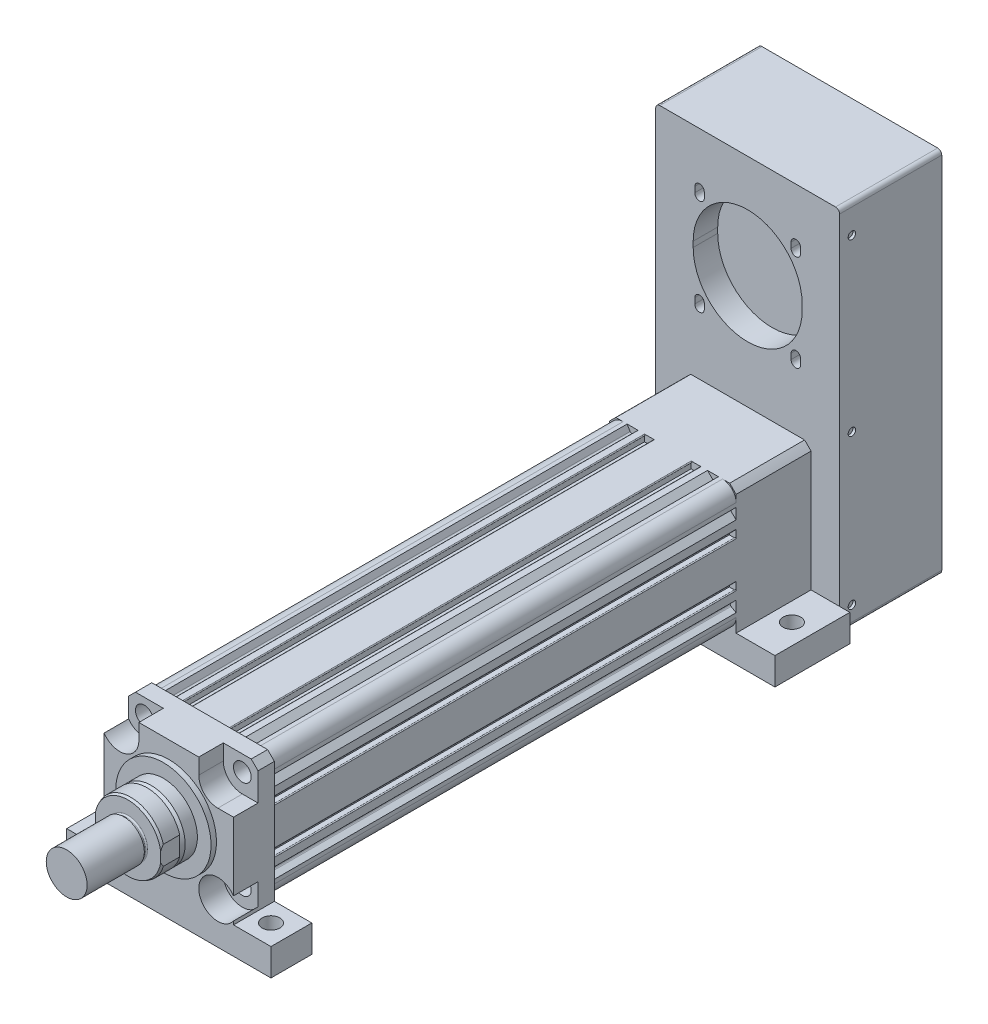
from build123d import *
from OCP.BRepFilletAPI import BRepFilletAPI_MakeChamfer

# Parameters (mm, degrees)
SKETCH_1_R           = 40
SKETCH_1_R_2         = 4.35
EXTRUDE_1_DEPTH      = 340
EXTRUDE_1_2_DEPTH    = 30
SKETCH_3_R           = 35
EXTRUDE_2_DEPTH      = 4
SKETCH_3_3_R         = 6.5
CUT_EXTRUDE_1_DEPTH  = 30
SKETCH_3_4_R         = 6.5
CUT_EXTRUDE_2_DEPTH  = 17
SKETCH_4_R           = 25
EXTRUDE_3_DEPTH      = 12
CHAMFER_1_SIZE       = 3
CHAMFER_1_SIZE2      = 1.732050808
EXTRUDE_4_DEPTH      = 14
CHAMFER_2_SIZE       = 2
CHAMFER_2_SIZE2      = 0.727940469
SKETCH_6_R           = 13.5
EXTRUDE_5_DEPTH      = 3
SKETCH_7_R           = 15
EXTRUDE_6_DEPTH      = 42
FILLET_1_R           = 1
EXTRUDE_7_DEPTH      = 55
SKETCH_12_W          = 135
SKETCH_12_H          = 270
EXTRUDE_9_DEPTH      = 75
CUT_EXTRUDE_5_DEPTH  = 18
CUT_EXTRUDE_6_DEPTH  = 18
CUT_EXTRUDE_START    = -11.5
CUT_EXTRUDE_7_DEPTH  = 6.5
SKETCH_14_R          = 2.75
CUT_EXTRUDE_8_DEPTH  = 2
SKETCH_15_R          = 2.75
CUT_EXTRUDE_9_DEPTH  = 2
SKETCH_16_W          = 150
SKETCH_16_H          = 55
SKETCH_16_R          = 6.5
SKETCH_16_H_2        = 30
EXTRUDE_10_DEPTH     = 20
FILLET_2_R           = 3
SKETCH_17_W          = 95
SKETCH_17_H          = 95
EXTRUDE_11_DEPTH     = 30
CUT_EXTRUDE_10_DEPTH = 18
SKETCH_19_R          = 6.5
CUT_EXTRUDE_11_DEPTH = 30
CHAMFER_3_SIZE       = 5


with BuildPart() as part:
    # Sketch 1 → Extrude 1 (new body)
    with BuildSketch(Plane.XY):
        with BuildLine():
            Line((46.5, -36.5), (46.5, -33.5))
            Line((46.5, -33.5), (42.782554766, -31.353731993))
            ThreePointArc((42.782554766, -31.353731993), (42.192820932, -30.47113294), (42.534026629, -29.465973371))
            Line((42.534026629, -29.465973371), (46.5, -25.5))
            Line((46.5, -25.5), (46.5, -19.6))
            ThreePointArc((46.5, -19.6), (46.353553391, -19.246446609), (46, -19.1))
            ThreePointArc((46, -19.1), (45.646446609, -19.246446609), (45.5, -19.6))
            Line((45.5, -19.6), (41.5, -19.6))
            Line((41.5, -19.6), (41.5, -13.5))
            Line((41.5, -13.5), (45.5, -13.5))
            ThreePointArc((45.5, -13.5), (45.646446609, -13.853553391), (46, -14))
            ThreePointArc((46, -14), (46.353553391, -13.853553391), (46.5, -13.5))
            Line((46.5, -13.5), (46.5, 13.5))
            ThreePointArc((46.5, 13.5), (46.353553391, 13.853553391), (46, 14))
            ThreePointArc((46, 14), (45.646446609, 13.853553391), (45.5, 13.5))
            Line((45.5, 13.5), (41.5, 13.5))
            Line((41.5, 13.5), (41.5, 19.6))
            Line((41.5, 19.6), (45.5, 19.6))
            ThreePointArc((45.5, 19.6), (45.646446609, 19.246446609), (46, 19.1))
            ThreePointArc((46, 19.1), (46.353553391, 19.246446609), (46.5, 19.6))
            Line((46.5, 19.6), (46.5, 25.5))
            Line((46.5, 25.5), (42.534026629, 29.465973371))
            ThreePointArc((42.534026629, 29.465973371), (42.192820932, 30.47113294), (42.782554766, 31.353731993))
            Line((42.782554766, 31.353731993), (46.5, 33.5))
            Line((46.5, 33.5), (46.5, 36.5))
            ThreePointArc((46.5, 36.5), (43.571067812, 43.571067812), (36.5, 46.5))
            Line((36.5, 46.5), (33.5, 46.5))
            Line((33.5, 46.5), (31.353731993, 42.782554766))
            ThreePointArc((31.353731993, 42.782554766), (30.47113294, 42.192820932), (29.465973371, 42.534026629))
            Line((29.465973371, 42.534026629), (25.5, 46.5))
            Line((25.5, 46.5), (20.8, 46.5))
            ThreePointArc((20.8, 46.5), (20.446446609, 46.353553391), (20.3, 46))
            ThreePointArc((20.3, 46), (20.446446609, 45.646446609), (20.8, 45.5))
            Line((20.8, 45.5), (20.8, 41.5))
            Line((20.8, 41.5), (13.5, 41.5))
            Line((13.5, 41.5), (13.5, 45.5))
            ThreePointArc((13.5, 45.5), (13.853553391, 45.646446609), (14, 46))
            ThreePointArc((14, 46), (13.853553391, 46.353553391), (13.5, 46.5))
            Line((13.5, 46.5), (-13.5, 46.5))
            ThreePointArc((-13.5, 46.5), (-13.853553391, 46.353553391), (-14, 46))
            ThreePointArc((-14, 46), (-13.853553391, 45.646446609), (-13.5, 45.5))
            Line((-13.5, 45.5), (-13.5, 41.5))
            Line((-13.5, 41.5), (-20.8, 41.5))
            Line((-20.8, 41.5), (-20.8, 45.5))
            ThreePointArc((-20.8, 45.5), (-20.446446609, 45.646446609), (-20.3, 46))
            ThreePointArc((-20.3, 46), (-20.446446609, 46.353553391), (-20.8, 46.5))
            Line((-20.8, 46.5), (-25.5, 46.5))
            Line((-25.5, 46.5), (-29.465973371, 42.534026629))
            ThreePointArc((-29.465973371, 42.534026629), (-30.47113294, 42.192820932), (-31.353731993, 42.782554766))
            Line((-31.353731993, 42.782554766), (-33.5, 46.5))
            Line((-33.5, 46.5), (-36.5, 46.5))
            ThreePointArc((-36.5, 46.5), (-43.571067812, 43.571067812), (-46.5, 36.5))
            Line((-46.5, 36.5), (-46.5, 33.5))
            Line((-46.5, 33.5), (-42.782554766, 31.353731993))
            ThreePointArc((-42.782554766, 31.353731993), (-42.192820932, 30.47113294), (-42.534026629, 29.465973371))
            Line((-42.534026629, 29.465973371), (-46.5, 25.5))
            Line((-46.5, 25.5), (-46.5, 20))
            ThreePointArc((-46.5, 20), (-46.353553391, 19.646446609), (-46, 19.5))
            ThreePointArc((-46, 19.5), (-45.646446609, 19.646446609), (-45.5, 20))
            Line((-45.5, 20), (-41.5, 20))
            Line((-41.5, 20), (-41.5, 13.9))
            Line((-41.5, 13.9), (-45.5, 13.9))
            ThreePointArc((-45.5, 13.9), (-45.646446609, 14.253553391), (-46, 14.4))
            ThreePointArc((-46, 14.4), (-46.353553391, 14.253553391), (-46.5, 13.9))
            Line((-46.5, 13.9), (-46.5, -13.9))
            ThreePointArc((-46.5, -13.9), (-46.353553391, -14.253553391), (-46, -14.4))
            ThreePointArc((-46, -14.4), (-45.646446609, -14.253553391), (-45.5, -13.9))
            Line((-45.5, -13.9), (-41.5, -13.9))
            Line((-41.5, -13.9), (-41.5, -20))
            Line((-41.5, -20), (-45.5, -20))
            ThreePointArc((-45.5, -20), (-45.646446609, -19.646446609), (-46, -19.5))
            ThreePointArc((-46, -19.5), (-46.353553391, -19.646446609), (-46.5, -20))
            Line((-46.5, -20), (-46.5, -25.5))
            Line((-46.5, -25.5), (-42.534026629, -29.465973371))
            ThreePointArc((-42.534026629, -29.465973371), (-42.192820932, -30.47113294), (-42.782554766, -31.353731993))
            Line((-42.782554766, -31.353731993), (-46.5, -33.5))
            Line((-46.5, -33.5), (-46.5, -36.5))
            ThreePointArc((-46.5, -36.5), (-43.571067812, -43.571067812), (-36.5, -46.5))
            Line((-36.5, -46.5), (-33.5, -46.5))
            Line((-33.5, -46.5), (-31.353731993, -42.782554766))
            ThreePointArc((-31.353731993, -42.782554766), (-30.47113294, -42.192820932), (-29.465973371, -42.534026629))
            Line((-29.465973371, -42.534026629), (-25.5, -46.5))
            Line((-25.5, -46.5), (25.5, -46.5))
            Line((25.5, -46.5), (29.465973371, -42.534026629))
            ThreePointArc((29.465973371, -42.534026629), (30.47113294, -42.192820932), (31.353731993, -42.782554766))
            Line((31.353731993, -42.782554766), (33.5, -46.5))
            Line((33.5, -46.5), (36.5, -46.5))
            ThreePointArc((36.5, -46.5), (43.571067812, -43.571067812), (46.5, -36.5))
        make_face()
        Circle(SKETCH_1_R, mode=Mode.SUBTRACT)
        with Locations((36, -36)):
            Circle(SKETCH_1_R_2, mode=Mode.SUBTRACT)
        with Locations((-36, -36)):
            Circle(SKETCH_1_R_2, mode=Mode.SUBTRACT)
        with Locations((36, 36)):
            Circle(SKETCH_1_R_2, mode=Mode.SUBTRACT)
        with Locations((-36, 36)):
            Circle(SKETCH_1_R_2, mode=Mode.SUBTRACT)
        with BuildLine():
            Line((25.75, -42.5), (11.324751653, -42.5))
            ThreePointArc((11.324751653, -42.5), (10.829080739, -42.065653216), (11.194582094, -41.517241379))
            ThreePointArc((11.194582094, -41.517241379), (18.919894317, -38.613956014), (25.948275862, -34.288292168))
            ThreePointArc((25.948275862, -34.288292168), (26.472640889, -34.239297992), (26.75, -34.68699324))
            Line((26.75, -34.68699324), (26.75, -41.5))
            Line((26.75, -41.5), (25.75, -42.5))
        make_face(mode=Mode.SUBTRACT)
        with BuildLine():
            Line((-25.75, -42.5), (-11.324751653, -42.5))
            ThreePointArc((-11.324751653, -42.5), (-10.829080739, -42.065653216), (-11.194582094, -41.517241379))
            ThreePointArc((-11.194582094, -41.517241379), (-18.919894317, -38.613956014), (-25.948275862, -34.288292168))
            ThreePointArc((-25.948275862, -34.288292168), (-26.472640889, -34.239297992), (-26.75, -34.68699324))
            Line((-26.75, -34.68699324), (-26.75, -41.5))
            Line((-26.75, -41.5), (-25.75, -42.5))
        make_face(mode=Mode.SUBTRACT)
        with BuildLine():
            Line((26.312283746, 40), (20.798294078, 40))
            ThreePointArc((20.798294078, 40), (20.548294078, 39.933012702), (20.365281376, 39.75))
            Line((20.365281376, 39.75), (19.794336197, 38.761093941))
            ThreePointArc((19.794336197, 38.761093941), (19.747068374, 38.372059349), (19.994850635, 38.068437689))
            ThreePointArc((19.994850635, 38.068437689), (22.57372353, 36.598183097), (25.045011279, 34.953503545))
            ThreePointArc((25.045011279, 34.953503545), (25.441798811, 34.871210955), (25.769245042, 35.109939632))
            Line((25.769245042, 35.109939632), (27.64187192, 38.353424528))
            ThreePointArc((27.64187192, 38.353424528), (27.704581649, 38.668687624), (27.562412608, 38.956977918))
            Line((27.562412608, 38.956977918), (26.665837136, 39.853553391))
            ThreePointArc((26.665837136, 39.853553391), (26.503625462, 39.961939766), (26.312283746, 40))
        make_face(mode=Mode.SUBTRACT)
        with BuildLine():
            Line((38.956977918, 27.562412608), (39.853553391, 26.665837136))
            ThreePointArc((39.853553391, 26.665837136), (39.961939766, 26.503625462), (40, 26.312283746))
            Line((40, 26.312283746), (40, 20.798294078))
            ThreePointArc((40, 20.798294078), (39.933012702, 20.548294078), (39.75, 20.365281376))
            Line((39.75, 20.365281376), (38.761093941, 19.794336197))
            ThreePointArc((38.761093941, 19.794336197), (38.372059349, 19.747068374), (38.068437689, 19.994850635))
            ThreePointArc((38.068437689, 19.994850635), (36.598183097, 22.57372353), (34.953503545, 25.045011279))
            ThreePointArc((34.953503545, 25.045011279), (34.871210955, 25.441798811), (35.109939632, 25.769245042))
            Line((35.109939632, 25.769245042), (38.353424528, 27.64187192))
            ThreePointArc((38.353424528, 27.64187192), (38.668687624, 27.704581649), (38.956977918, 27.562412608))
        make_face(mode=Mode.SUBTRACT)
        with BuildLine():
            Line((38.956977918, -27.562412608), (39.853553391, -26.665837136))
            ThreePointArc((39.853553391, -26.665837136), (39.961939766, -26.503625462), (40, -26.312283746))
            Line((40, -26.312283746), (40, -20.798294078))
            ThreePointArc((40, -20.798294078), (39.933012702, -20.548294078), (39.75, -20.365281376))
            Line((39.75, -20.365281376), (38.761093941, -19.794336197))
            ThreePointArc((38.761093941, -19.794336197), (38.372059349, -19.747068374), (38.068437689, -19.994850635))
            ThreePointArc((38.068437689, -19.994850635), (36.598183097, -22.57372353), (34.953503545, -25.045011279))
            ThreePointArc((34.953503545, -25.045011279), (34.871210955, -25.441798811), (35.109939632, -25.769245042))
            Line((35.109939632, -25.769245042), (38.353424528, -27.64187192))
            ThreePointArc((38.353424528, -27.64187192), (38.668687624, -27.704581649), (38.956977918, -27.562412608))
        make_face(mode=Mode.SUBTRACT)
        with BuildLine():
            Line((-39.75, -20.365281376), (-38.761093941, -19.794336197))
            ThreePointArc((-38.761093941, -19.794336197), (-38.372059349, -19.747068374), (-38.068437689, -19.994850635))
            ThreePointArc((-38.068437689, -19.994850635), (-36.598183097, -22.57372353), (-34.953503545, -25.045011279))
            ThreePointArc((-34.953503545, -25.045011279), (-34.871210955, -25.441798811), (-35.109939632, -25.769245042))
            Line((-35.109939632, -25.769245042), (-38.353424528, -27.64187192))
            ThreePointArc((-38.353424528, -27.64187192), (-38.668687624, -27.704581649), (-38.956977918, -27.562412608))
            Line((-38.956977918, -27.562412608), (-39.853553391, -26.665837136))
            ThreePointArc((-39.853553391, -26.665837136), (-39.961939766, -26.503625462), (-40, -26.312283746))
            Line((-40, -26.312283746), (-40, -20.798294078))
            ThreePointArc((-40, -20.798294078), (-39.933012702, -20.548294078), (-39.75, -20.365281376))
        make_face(mode=Mode.SUBTRACT)
        with BuildLine():
            Line((-20.365281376, 39.75), (-19.794336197, 38.761093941))
            ThreePointArc((-19.794336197, 38.761093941), (-19.747068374, 38.372059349), (-19.994850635, 38.068437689))
            ThreePointArc((-19.994850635, 38.068437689), (-22.57372353, 36.598183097), (-25.045011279, 34.953503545))
            ThreePointArc((-25.045011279, 34.953503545), (-25.441798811, 34.871210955), (-25.769245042, 35.109939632))
            Line((-25.769245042, 35.109939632), (-27.64187192, 38.353424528))
            ThreePointArc((-27.64187192, 38.353424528), (-27.704581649, 38.668687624), (-27.562412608, 38.956977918))
            Line((-27.562412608, 38.956977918), (-26.665837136, 39.853553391))
            ThreePointArc((-26.665837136, 39.853553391), (-26.503625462, 39.961939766), (-26.312283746, 40))
            Line((-26.312283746, 40), (-20.798294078, 40))
            ThreePointArc((-20.798294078, 40), (-20.548294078, 39.933012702), (-20.365281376, 39.75))
        make_face(mode=Mode.SUBTRACT)
        with BuildLine():
            Line((-38.956977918, 27.562412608), (-39.853553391, 26.665837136))
            ThreePointArc((-39.853553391, 26.665837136), (-39.961939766, 26.503625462), (-40, 26.312283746))
            Line((-40, 26.312283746), (-40, 20.798294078))
            ThreePointArc((-40, 20.798294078), (-39.933012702, 20.548294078), (-39.75, 20.365281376))
            Line((-39.75, 20.365281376), (-38.761093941, 19.794336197))
            ThreePointArc((-38.761093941, 19.794336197), (-38.372059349, 19.747068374), (-38.068437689, 19.994850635))
            ThreePointArc((-38.068437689, 19.994850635), (-36.598183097, 22.57372353), (-34.953503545, 25.045011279))
            ThreePointArc((-34.953503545, 25.045011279), (-34.871210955, 25.441798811), (-35.109939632, 25.769245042))
            Line((-35.109939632, 25.769245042), (-38.353424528, 27.64187192))
            ThreePointArc((-38.353424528, 27.64187192), (-38.668687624, 27.704581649), (-38.956977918, 27.562412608))
        make_face(mode=Mode.SUBTRACT)
    extrude(amount=EXTRUDE_1_DEPTH)

    # Sketch 2 → Extrude 1 2 (add)
    with BuildSketch(Plane.XY.offset(340)):
        Polygon((-47.5, 45.5), (-45.5, 47.5), (45.5, 47.5), (47.5, 45.5), (47.5, -45.5), (47.5, -47.5), (45.5, -47.5), (-45.5, -47.5), (-47.5, -47.5), (-47.5, -45.5), align=None)
    extrude(amount=EXTRUDE_1_2_DEPTH)

    # Sketch 3 → Extrude 2 (add)
    with BuildSketch(Plane.XY.offset(370)):
        Circle(SKETCH_3_R)
    extrude(amount=EXTRUDE_2_DEPTH)

    # Sketch 3_3 → Cut-Extrude 1 (cut)
    with BuildSketch(Plane.XY.offset(370)):
        with Locations((-36, 36)):
            Circle(SKETCH_3_3_R)
        with Locations((36, 36)):
            Circle(SKETCH_3_3_R)
        with Locations((60, 32.5)):
            Circle(SKETCH_3_3_R)
        with Locations((36, -36)):
            Circle(SKETCH_3_3_R)
        with Locations((-36, -36)):
            Circle(SKETCH_3_3_R)
        with Locations((-60, -32.5)):
            Circle(SKETCH_3_3_R)
        with Locations((-60, 32.5)):
            Circle(SKETCH_3_3_R)
    extrude(amount=-CUT_EXTRUDE_1_DEPTH, mode=Mode.SUBTRACT)

    # Sketch 3_4 → Cut-Extrude 2 (cut)
    # profile 1 of 4: a face of its own
    with BuildSketch(Plane.XY.offset(370)):
        with BuildLine():
            Line((-47.5, 45.5), (-47.5, 28.015640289))
            ThreePointArc((-47.5, 28.015640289), (-31.816699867, 22.639610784), (-22, 36))
            Line((-22, 36), (-22, 47.5))
            Line((-22, 47.5), (-45.5, 47.5))
            Line((-45.5, 47.5), (-47.5, 45.5))
        make_face()
        with Locations((-36, 36)):
            Circle(SKETCH_3_4_R, mode=Mode.SUBTRACT)
    # profile 2 of 4: a face of its own
    with BuildSketch(Plane.XY.offset(370)):
        with BuildLine():
            ThreePointArc((-22, -36), (-31.816699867, -22.639610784), (-47.5, -28.015640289))
            Line((-47.5, -28.015640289), (-47.5, -47.5))
            Line((-47.5, -47.5), (-22, -47.5))
            Line((-22, -47.5), (-22, -36))
        make_face()
        with Locations((-36, -36)):
            Circle(SKETCH_3_4_R, mode=Mode.SUBTRACT)
    # profile 3 of 4: a face of its own
    with BuildSketch(Plane.XY.offset(370)):
        with BuildLine():
            Line((45.5, 47.5), (22, 47.5))
            Line((22, 47.5), (22, 36))
            ThreePointArc((22, 36), (31.816699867, 22.639610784), (47.5, 28.015640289))
            Line((47.5, 28.015640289), (47.5, 45.5))
            Line((47.5, 45.5), (45.5, 47.5))
        make_face()
        with Locations((36, 36)):
            Circle(SKETCH_3_4_R, mode=Mode.SUBTRACT)
    # profile 4 of 4: a face of its own
    with BuildSketch(Plane.XY.offset(370)):
        with BuildLine():
            Line((22, -36), (22, -47.5))
            Line((22, -47.5), (47.5, -47.5))
            Line((47.5, -47.5), (47.5, -28.015640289))
            ThreePointArc((47.5, -28.015640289), (31.816699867, -22.639610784), (22, -36))
        make_face()
        with Locations((36, -36)):
            Circle(SKETCH_3_4_R, mode=Mode.SUBTRACT)
    extrude(amount=-CUT_EXTRUDE_2_DEPTH, mode=Mode.SUBTRACT)

    # Sketch 4 → Extrude 3 (add)
    with BuildSketch(Plane.XY.offset(374)):
        Circle(SKETCH_4_R)
    extrude(amount=EXTRUDE_3_DEPTH)

    # Chamfer 1
    chamfer_1_edges = [part.edges().sort_by_distance(p)[0] for p in [
        (-25, 0, 386),
    ]]
    chamfer_1_side = [part.faces().sort_by_distance(p)[0] for p in [
        (-25, 0, 380),
    ]]
    chamfer(chamfer_1_edges, length=CHAMFER_1_SIZE, length2=CHAMFER_1_SIZE2, reference=chamfer_1_side[0])

    # Sketch 5 → Extrude 4 (add)
    with BuildSketch(Plane.XY.offset(386)):
        with BuildLine():
            Line((-24, 7), (-24, -7))
            ThreePointArc((-24, -7), (0, -25), (24, -7))
            Line((24, -7), (24, 7))
            ThreePointArc((24, 7), (0, 25), (-24, 7))
        make_face()
    extrude(amount=EXTRUDE_4_DEPTH)

    # Chamfer 2: one chamfer whose edges measure the first distance from different faces: ONE call of the kernel's chamfer builder (chamfer() names one face for all edges)
    chamfer_2_edges_1 = [part.edges().sort_by_distance(p)[0] for p in [
        (0, 25, 400),
    ]]
    chamfer_2_side_1 = [part.faces().sort_by_distance(p)[0] for p in [
        (0, 25, 393),
    ]]
    chamfer_2_edges_2 = [part.edges().sort_by_distance(p)[0] for p in [
        (0, -25, 400),
    ]]
    chamfer_2_side_2 = [part.faces().sort_by_distance(p)[0] for p in [
        (0, -25, 393),
    ]]
    chamfer_2 = BRepFilletAPI_MakeChamfer(part.part.solid().wrapped)
    for e in chamfer_2_edges_1:
        chamfer_2.Add(CHAMFER_2_SIZE, CHAMFER_2_SIZE2, e.wrapped, chamfer_2_side_1[0].wrapped)  # the first distance lies on this face
    for e in chamfer_2_edges_2:
        chamfer_2.Add(CHAMFER_2_SIZE, CHAMFER_2_SIZE2, e.wrapped, chamfer_2_side_2[0].wrapped)  # the first distance lies on this face
    add(Compound.cast(chamfer_2.Shape()), mode=Mode.REPLACE)

    # Sketch 6 → Extrude 5 (add)
    with BuildSketch(Plane.XY.offset(400)):
        Circle(SKETCH_6_R)
    extrude(amount=EXTRUDE_5_DEPTH)

    # Sketch 7 → Extrude 6 (add)
    with BuildSketch(Plane.XY.offset(403)):
        with Locations(Location((0, 0, 0), (0, 0, 180))):
            Circle(SKETCH_7_R)
    extrude(amount=EXTRUDE_6_DEPTH)

    # Fillet 1
    fillet_1_edges = [part.edges().sort_by_distance(p)[0] for p in [
        (-13.5, 0, 400),
    ]]
    fillet(fillet_1_edges, radius=FILLET_1_R)



with BuildPart() as body_2:
    # Sketch 8 → Extrude 7 (new body)
    with BuildSketch(Plane(origin=(0, 0, 0), x_dir=(-1, 0, 0), z_dir=(0, 0, -1))):
        with BuildLine():
            Line((46.5, -41.761226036), (46.5, -46.5))
            Line((46.5, -46.5), (41.761226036, -46.5))
            Line((41.761226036, -46.5), (-41.761226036, -46.5))
            Line((-41.761226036, -46.5), (-46.5, -46.5))
            Line((-46.5, -46.5), (-46.5, -41.761226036))
            Line((-46.5, -41.761226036), (-46.5, 41.761226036))
            ThreePointArc((-46.5, 41.761226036), (-44.194173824, 44.194173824), (-41.761226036, 46.5))
            Line((-41.761226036, 46.5), (41.761226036, 46.5))
            ThreePointArc((41.761226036, 46.5), (44.194173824, 44.194173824), (46.5, 41.761226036))
            Line((46.5, 41.761226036), (46.5, -41.761226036))
        make_face()
    extrude(amount=EXTRUDE_7_DEPTH)

    # Sketch 12 → Extrude 9 (add)
    with BuildSketch(Plane(origin=(0, 0, -55), x_dir=(-1, 0, 0), z_dir=(0, 0, -1))):
        with Locations((0, 71)):
            Rectangle(SKETCH_12_W, SKETCH_12_H)
    extrude(amount=EXTRUDE_9_DEPTH)

    # Sketch 13 → Cut-Extrude 5 (cut)
    with BuildSketch(Plane.XY.offset(-55)):
        with BuildLine():
            Line((-40, 132), (-40, 128))
            ThreePointArc((-40, 128), (0, 88), (40, 128))
            Line((40, 128), (40, 132))
            ThreePointArc((40, 132), (0, 172), (-40, 132))
        make_face()
    extrude(amount=-CUT_EXTRUDE_5_DEPTH, mode=Mode.SUBTRACT)

    # Sketch 13_3 → Cut-Extrude 6 (cut)
    with BuildSketch(Plane.XY.offset(-55)):
        with BuildLine():
            ThreePointArc((31.855339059, 167.355339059), (35.355339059, 170.855339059), (38.855339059, 167.355339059))
            Line((38.855339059, 167.355339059), (38.855339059, 163.355339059))
            ThreePointArc((38.855339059, 163.355339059), (35.355339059, 159.855339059), (31.855339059, 163.355339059))
            Line((31.855339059, 163.355339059), (31.855339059, 167.355339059))
        make_face()
        with BuildLine():
            ThreePointArc((-31.855339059, 92.644660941), (-35.355339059, 89.144660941), (-38.855339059, 92.644660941))
            Line((-38.855339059, 92.644660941), (-38.855339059, 96.644660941))
            ThreePointArc((-38.855339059, 96.644660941), (-35.355339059, 100.144660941), (-31.855339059, 96.644660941))
            Line((-31.855339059, 96.644660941), (-31.855339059, 92.644660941))
        make_face()
        with BuildLine():
            ThreePointArc((-31.855339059, 167.355339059), (-35.355339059, 170.855339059), (-38.855339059, 167.355339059))
            Line((-38.855339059, 167.355339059), (-38.855339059, 163.355339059))
            ThreePointArc((-38.855339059, 163.355339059), (-35.355339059, 159.855339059), (-31.855339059, 163.355339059))
            Line((-31.855339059, 163.355339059), (-31.855339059, 167.355339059))
        make_face()
        with BuildLine():
            ThreePointArc((38.855339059, 96.644660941), (35.355339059, 100.144660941), (31.855339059, 96.644660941))
            Line((31.855339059, 96.644660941), (31.855339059, 92.644660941))
            ThreePointArc((31.855339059, 92.644660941), (35.355339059, 89.144660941), (38.855339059, 92.644660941))
            Line((38.855339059, 92.644660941), (38.855339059, 96.644660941))
        make_face()
    extrude(amount=-CUT_EXTRUDE_6_DEPTH, mode=Mode.SUBTRACT)

    # Sketch 13_4 → Cut-Extrude 7 (cut)
    with BuildSketch(Plane.XY.offset(-55).offset(CUT_EXTRUDE_START)):
        with BuildLine():
            Line((-40.555339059, 163.305339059), (-40.555339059, 167.405339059))
            ThreePointArc((-40.555339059, 167.405339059), (-35.355339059, 172.605339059), (-30.155339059, 167.405339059))
            Line((-30.155339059, 167.405339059), (-30.155339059, 163.305339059))
            ThreePointArc((-30.155339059, 163.305339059), (-35.355339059, 158.105339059), (-40.555339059, 163.305339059))
        make_face()
        with BuildLine():
            Line((40.555339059, 163.305339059), (40.555339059, 167.405339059))
            ThreePointArc((40.555339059, 167.405339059), (35.355339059, 172.605339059), (30.155339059, 167.405339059))
            Line((30.155339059, 167.405339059), (30.155339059, 163.305339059))
            ThreePointArc((30.155339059, 163.305339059), (35.355339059, 158.105339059), (40.555339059, 163.305339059))
        make_face()
        with BuildLine():
            Line((40.555339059, 96.694660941), (40.555339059, 92.594660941))
            ThreePointArc((40.555339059, 92.594660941), (35.355339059, 87.394660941), (30.155339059, 92.594660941))
            Line((30.155339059, 92.594660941), (30.155339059, 96.694660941))
            ThreePointArc((30.155339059, 96.694660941), (35.355339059, 101.894660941), (40.555339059, 96.694660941))
        make_face()
        with BuildLine():
            Line((-40.555339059, 96.694660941), (-40.555339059, 92.594660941))
            ThreePointArc((-40.555339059, 92.594660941), (-35.355339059, 87.394660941), (-30.155339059, 92.594660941))
            Line((-30.155339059, 92.594660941), (-30.155339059, 96.694660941))
            ThreePointArc((-30.155339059, 96.694660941), (-35.355339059, 101.894660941), (-40.555339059, 96.694660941))
        make_face()
    extrude(amount=-CUT_EXTRUDE_7_DEPTH, mode=Mode.SUBTRACT)

    # Sketch 14 → Cut-Extrude 8 (cut)
    with BuildSketch(Plane.ZY.offset(67.5)):
        with Locations(Location((-64, -50, 0), (0, 0, 270))):
            Circle(SKETCH_14_R)
        with Locations(Location((-64, 60, 0), (0, 0, 270))):
            Circle(SKETCH_14_R)
        with Locations(Location((-64, 185, 0), (0, 0, 270))):
            Circle(SKETCH_14_R)
    extrude(amount=-CUT_EXTRUDE_8_DEPTH, mode=Mode.SUBTRACT)

    # Sketch 15 → Cut-Extrude 9 (cut)
    with BuildSketch(Plane(origin=(67.5, 0, 0), x_dir=(0, 0, -1), z_dir=(1, 0, 0))):
        with Locations(Location((64, -50, 0), (0, 0, 270))):
            Circle(SKETCH_15_R)
        with Locations(Location((64, 60, 0), (0, 0, 270))):
            Circle(SKETCH_15_R)
        with Locations(Location((64, 185, 0), (0, 0, 270))):
            Circle(SKETCH_15_R)
    extrude(amount=-CUT_EXTRUDE_9_DEPTH, mode=Mode.SUBTRACT)


with BuildPart() as part_1:
    add(part.part)

    add(body_2.part)  # Extrude 10 merges body 2
    # Sketch 16 → Extrude 10 (add)
    # profile 1 of 2: a face of its own
    with BuildSketch(Plane.XZ.offset(46.5)):
        with Locations((0, -27.5)):
            Rectangle(SKETCH_16_W, SKETCH_16_H)
        with Locations(Location((-60, -27.5, 0), (0, 0, 270))):
            Circle(SKETCH_16_R, mode=Mode.SUBTRACT)
        with Locations(Location((60, -27.5, 0), (0, 0, 270))):
            Circle(SKETCH_16_R, mode=Mode.SUBTRACT)
    # profile 2 of 2: a face of its own
    with BuildSketch(Plane.XZ.offset(46.5)):
        with Locations((0, 355)):
            Rectangle(SKETCH_16_W, SKETCH_16_H_2)
        with Locations(Location((-60, 355, 0), (0, 0, 270))):
            Circle(SKETCH_16_R, mode=Mode.SUBTRACT)
        with Locations(Location((60, 355, 0), (0, 0, 270))):
            Circle(SKETCH_16_R, mode=Mode.SUBTRACT)
    extrude(amount=EXTRUDE_10_DEPTH)

    # Fillet 2
    fillet_2_edges = [part_1.edges().sort_by_distance(p)[0] for p in [
        (-67.5, -64, -92.5),
        (-67.5, 206, -92.5),
        (67.5, 206, -92.5),
        (67.5, -64, -92.5),
    ]]
    fillet(fillet_2_edges, radius=FILLET_2_R)

    # Sketch 17 → Extrude 11 (add)
    with BuildSketch(Plane.XY.offset(370)):
        Rectangle(SKETCH_17_W, SKETCH_17_H)
    extrude(amount=-EXTRUDE_11_DEPTH)

    # Sketch 18 → Cut-Extrude 10 (cut)
    with BuildSketch(Plane.XY.offset(370)):
        with BuildLine():
            ThreePointArc((-47.5, 28.015640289), (-31.816699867, 22.639610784), (-22, 36))
            ThreePointArc((-22, 36), (-23.594738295, 42.489181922), (-28.015640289, 47.5))
            Line((-28.015640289, 47.5), (-43.984359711, 47.5))
            ThreePointArc((-43.984359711, 47.5), (-45.899494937, 45.899494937), (-47.5, 43.984359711))
            Line((-47.5, 43.984359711), (-47.5, 28.015640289))
        make_face()
        with BuildLine():
            ThreePointArc((-47.5, 43.984359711), (-45.899494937, 45.899494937), (-43.984359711, 47.5))
            Line((-43.984359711, 47.5), (-47.5, 47.5))
            Line((-47.5, 47.5), (-47.5, 43.984359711))
        make_face()
        with BuildLine():
            ThreePointArc((-28.015640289, 47.5), (-23.594738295, 42.489181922), (-22, 36))
            Line((-22, 36), (-22, 47.5))
            Line((-22, 47.5), (-28.015640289, 47.5))
        make_face()
        with BuildLine():
            ThreePointArc((-50, 36), (-49.360389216, 31.816699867), (-47.5, 28.015640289))
            Line((-47.5, 28.015640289), (-47.5, 43.984359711))
            ThreePointArc((-47.5, 43.984359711), (-49.360389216, 40.183300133), (-50, 36))
        make_face()
        with BuildLine():
            ThreePointArc((28.015640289, 47.5), (23.594738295, 42.489181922), (22, 36))
            ThreePointArc((22, 36), (26.100505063, 26.100505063), (36, 22))
            ThreePointArc((36, 22), (42.489181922, 23.594738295), (47.5, 28.015640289))
            Line((47.5, 28.015640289), (47.5, 43.984359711))
            ThreePointArc((47.5, 43.984359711), (45.899494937, 45.899494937), (43.984359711, 47.5))
            Line((43.984359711, 47.5), (28.015640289, 47.5))
        make_face()
        with BuildLine():
            Line((47.5, 47.5), (43.984359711, 47.5))
            ThreePointArc((43.984359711, 47.5), (45.899494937, 45.899494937), (47.5, 43.984359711))
            Line((47.5, 43.984359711), (47.5, 47.5))
        make_face()
        with BuildLine():
            Line((28.015640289, 47.5), (22, 47.5))
            Line((22, 47.5), (22, 36))
            ThreePointArc((22, 36), (23.594738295, 42.489181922), (28.015640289, 47.5))
        make_face()
        with BuildLine():
            ThreePointArc((47.5, 28.015640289), (42.489181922, 23.594738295), (36, 22))
            Line((36, 22), (47.5, 22))
            Line((47.5, 22), (47.5, 28.015640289))
        make_face()
        with BuildLine():
            ThreePointArc((50, -36), (49.360389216, -31.816699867), (47.5, -28.015640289))
            Line((47.5, -28.015640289), (47.5, -43.984359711))
            ThreePointArc((47.5, -43.984359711), (49.360389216, -40.183300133), (50, -36))
        make_face()
        with BuildLine():
            Line((47.5, -43.984359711), (47.5, -28.015640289))
            ThreePointArc((47.5, -28.015640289), (22, -36), (47.5, -43.984359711))
        make_face()
        with BuildLine():
            ThreePointArc((-22, -36), (-31.816699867, -22.639610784), (-47.5, -28.015640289))
            Line((-47.5, -28.015640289), (-47.5, -43.984359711))
            ThreePointArc((-47.5, -43.984359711), (-31.816699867, -49.360389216), (-22, -36))
        make_face()
        with BuildLine():
            Line((-47.5, -43.984359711), (-47.5, -28.015640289))
            ThreePointArc((-47.5, -28.015640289), (-50, -36), (-47.5, -43.984359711))
        make_face()
        with BuildLine():
            ThreePointArc((-47.5, 28.015640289), (-31.816699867, 22.639610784), (-22, 36))
            ThreePointArc((-22, 36), (-23.594738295, 42.489181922), (-28.015640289, 47.5))
            Line((-28.015640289, 47.5), (-43.984359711, 47.5))
            ThreePointArc((-43.984359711, 47.5), (-45.899494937, 45.899494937), (-47.5, 43.984359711))
            Line((-47.5, 43.984359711), (-47.5, 28.015640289))
        make_face()
        with BuildLine():
            ThreePointArc((-47.5, 43.984359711), (-45.899494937, 45.899494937), (-43.984359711, 47.5))
            Line((-43.984359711, 47.5), (-47.5, 47.5))
            Line((-47.5, 47.5), (-47.5, 43.984359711))
        make_face()
        with BuildLine():
            ThreePointArc((28.015640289, 47.5), (23.594738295, 42.489181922), (22, 36))
            ThreePointArc((22, 36), (26.100505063, 26.100505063), (36, 22))
            ThreePointArc((36, 22), (42.489181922, 23.594738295), (47.5, 28.015640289))
            Line((47.5, 28.015640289), (47.5, 43.984359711))
            ThreePointArc((47.5, 43.984359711), (45.899494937, 45.899494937), (43.984359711, 47.5))
            Line((43.984359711, 47.5), (28.015640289, 47.5))
        make_face()
        with BuildLine():
            Line((47.5, 47.5), (43.984359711, 47.5))
            ThreePointArc((43.984359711, 47.5), (45.899494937, 45.899494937), (47.5, 43.984359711))
            Line((47.5, 43.984359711), (47.5, 47.5))
        make_face()
    extrude(amount=-CUT_EXTRUDE_10_DEPTH, mode=Mode.SUBTRACT)

    # Sketch 19 → Cut-Extrude 11 (cut)
    with BuildSketch(Plane.XY.offset(352)):
        with Locations((-36, 36)):
            Circle(SKETCH_19_R)
        with Locations((36, 36)):
            Circle(SKETCH_19_R)
        with Locations((36, -36)):
            Circle(SKETCH_19_R)
        with Locations((-36, -36)):
            Circle(SKETCH_19_R)
    extrude(amount=-CUT_EXTRUDE_11_DEPTH, mode=Mode.SUBTRACT)

    # Chamfer 3
    chamfer_3_edges = [part_1.edges().sort_by_distance(p)[0] for p in [
        (-47.5, 47.5, 346),
        (47.5, 47.5, 346),
    ]]
    chamfer(chamfer_3_edges, length=CHAMFER_3_SIZE)


solid = part_1.part
